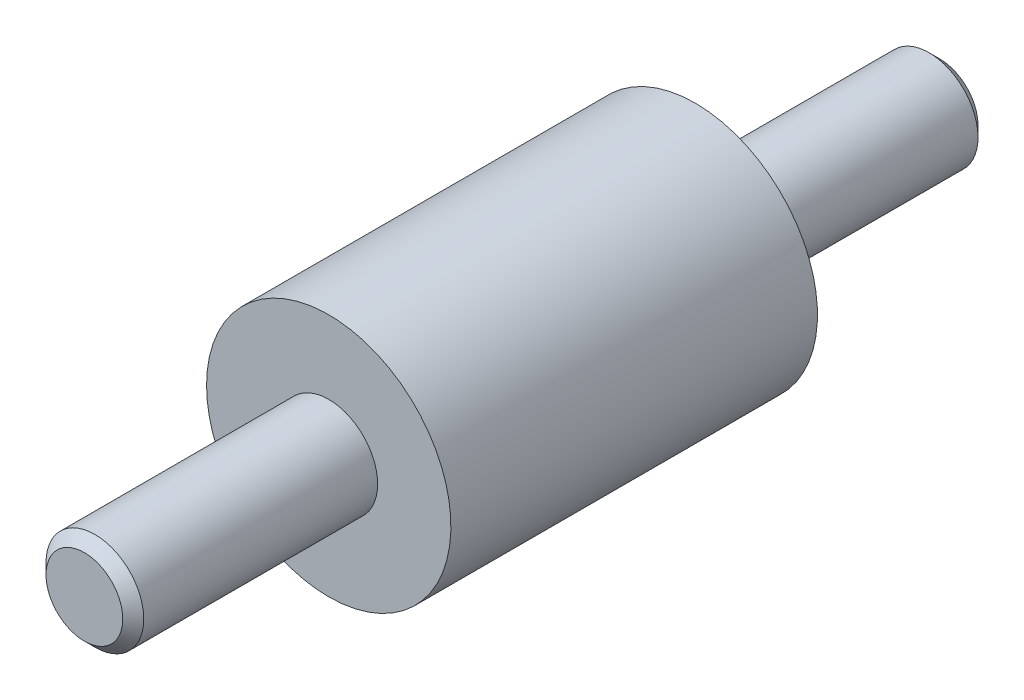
ISO-10303-21;
HEADER;
FILE_DESCRIPTION(('STEP AP214'),'2;1');
FILE_NAME('part.step','',(''),(''),'','','');
FILE_SCHEMA(('AUTOMOTIVE_DESIGN { 1 0 10303 214 1 1 1 1 }'));
ENDSEC;
DATA;
#1=APPLICATION_CONTEXT('core data for automotive mechanical design processes');
#2=APPLICATION_PROTOCOL_DEFINITION('international standard','automotive_design',2000,#1);
#3=PRODUCT_CONTEXT('',#1,'mechanical');
#4=PRODUCT('Part','Part','',(#3));
#5=PRODUCT_RELATED_PRODUCT_CATEGORY('part','',(#4));
#6=PRODUCT_DEFINITION_FORMATION('','',#4);
#7=PRODUCT_DEFINITION_CONTEXT('part definition',#1,'design');
#8=PRODUCT_DEFINITION('design','',#6,#7);
#9=PRODUCT_DEFINITION_SHAPE('','',#8);
#10=(LENGTH_UNIT() NAMED_UNIT(*) SI_UNIT(.MILLI.,.METRE.));
#11=(NAMED_UNIT(*) PLANE_ANGLE_UNIT() SI_UNIT($,.RADIAN.));
#12=(NAMED_UNIT(*) SI_UNIT($,.STERADIAN.) SOLID_ANGLE_UNIT());
#13=UNCERTAINTY_MEASURE_WITH_UNIT(LENGTH_MEASURE(1.E-05),#10,'distance_accuracy_value','');
#14=(GEOMETRIC_REPRESENTATION_CONTEXT(3) GLOBAL_UNCERTAINTY_ASSIGNED_CONTEXT((#13)) GLOBAL_UNIT_ASSIGNED_CONTEXT((#10,
#11,#12)) REPRESENTATION_CONTEXT('',''));
#15=CARTESIAN_POINT('',(0.,0.,0.));
#16=DIRECTION('',(0.,0.,1.));
#17=DIRECTION('',(1.,0.,0.));
#18=AXIS2_PLACEMENT_3D('',#15,#16,#17);
#19=CARTESIAN_POINT('',(0.,0.,0.33333333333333));
#20=DIRECTION('',(0.,0.,1.));
#21=DIRECTION('',(0.,-1.,0.));
#22=AXIS2_PLACEMENT_3D('',#19,#20,#21);
#23=CYLINDRICAL_SURFACE('',#22,5.);
#24=CARTESIAN_POINT('',(0.,0.,0.));
#25=DIRECTION('',(0.,0.,1.));
#26=DIRECTION('',(0.,-1.,0.));
#27=AXIS2_PLACEMENT_3D('',#24,#25,#26);
#28=CIRCLE('',#27,5.);
#29=CARTESIAN_POINT('',(0.,-5.,0.));
#30=VERTEX_POINT('',#29);
#31=EDGE_CURVE('E22',#30,#30,#28,.T.);
#32=ORIENTED_EDGE('',*,*,#31,.T.);
#33=EDGE_LOOP('',(#32));
#34=FACE_BOUND('',#33,.T.);
#35=CARTESIAN_POINT('',(0.,0.,15.));
#36=DIRECTION('',(0.,0.,-1.));
#37=DIRECTION('',(-1.,0.,0.));
#38=AXIS2_PLACEMENT_3D('',#35,#36,#37);
#39=CIRCLE('',#38,5.);
#40=CARTESIAN_POINT('',(-5.,0.,15.));
#41=VERTEX_POINT('',#40);
#42=EDGE_CURVE('E34',#41,#41,#39,.T.);
#43=ORIENTED_EDGE('',*,*,#42,.T.);
#44=EDGE_LOOP('',(#43));
#45=FACE_BOUND('',#44,.T.);
#46=ADVANCED_FACE('F12',(#34,#45),#23,.T.);
#47=CARTESIAN_POINT('',(5.,0.,0.));
#48=DIRECTION('',(0.,0.,-1.));
#49=DIRECTION('',(0.,1.,0.));
#50=AXIS2_PLACEMENT_3D('',#47,#48,#49);
#51=PLANE('',#50);
#52=CARTESIAN_POINT('',(0.,0.,0.));
#53=DIRECTION('',(0.,0.,-1.));
#54=DIRECTION('',(0.,1.,0.));
#55=AXIS2_PLACEMENT_3D('',#52,#53,#54);
#56=CIRCLE('',#55,2.);
#57=CARTESIAN_POINT('',(0.,2.,0.));
#58=VERTEX_POINT('',#57);
#59=EDGE_CURVE('E18',#58,#58,#56,.T.);
#60=ORIENTED_EDGE('',*,*,#59,.F.);
#61=EDGE_LOOP('',(#60));
#62=FACE_BOUND('',#61,.T.);
#63=ORIENTED_EDGE('',*,*,#31,.F.);
#64=EDGE_LOOP('',(#63));
#65=FACE_BOUND('',#64,.T.);
#66=ADVANCED_FACE('F57',(#62,#65),#51,.T.);
#67=CARTESIAN_POINT('',(0.,0.,-10.));
#68=DIRECTION('',(0.,0.,1.));
#69=DIRECTION('',(0.,-1.,0.));
#70=AXIS2_PLACEMENT_3D('',#67,#68,#69);
#71=CYLINDRICAL_SURFACE('',#70,2.);
#72=CARTESIAN_POINT('',(0.,0.,-9.5705));
#73=DIRECTION('',(0.,0.,1.));
#74=DIRECTION('',(0.,-1.,0.));
#75=AXIS2_PLACEMENT_3D('',#72,#73,#74);
#76=CIRCLE('',#75,2.);
#77=CARTESIAN_POINT('',(0.,-2.,-9.5705));
#78=VERTEX_POINT('',#77);
#79=EDGE_CURVE('E26',#78,#78,#76,.T.);
#80=ORIENTED_EDGE('',*,*,#79,.T.);
#81=EDGE_LOOP('',(#80));
#82=FACE_BOUND('',#81,.T.);
#83=ORIENTED_EDGE('',*,*,#59,.T.);
#84=EDGE_LOOP('',(#83));
#85=FACE_BOUND('',#84,.T.);
#86=ADVANCED_FACE('F62',(#82,#85),#71,.T.);
#87=CARTESIAN_POINT('',(0.,0.,-9.5705));
#88=DIRECTION('',(0.,0.,1.));
#89=DIRECTION('',(0.,-1.,0.));
#90=AXIS2_PLACEMENT_3D('',#87,#88,#89);
#91=CONICAL_SURFACE('',#90,2.,0.785398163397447);
#92=CARTESIAN_POINT('',(0.,0.,-10.));
#93=DIRECTION('',(0.,0.,1.));
#94=DIRECTION('',(0.,-1.,0.));
#95=AXIS2_PLACEMENT_3D('',#92,#93,#94);
#96=CIRCLE('',#95,1.5705);
#97=CARTESIAN_POINT('',(0.,-1.5705,-10.));
#98=VERTEX_POINT('',#97);
#99=EDGE_CURVE('E31',#98,#98,#96,.T.);
#100=ORIENTED_EDGE('',*,*,#99,.T.);
#101=EDGE_LOOP('',(#100));
#102=FACE_BOUND('',#101,.T.);
#103=ORIENTED_EDGE('',*,*,#79,.F.);
#104=EDGE_LOOP('',(#103));
#105=FACE_BOUND('',#104,.T.);
#106=ADVANCED_FACE('F78',(#102,#105),#91,.T.);
#107=CARTESIAN_POINT('',(1.5705,0.,-10.));
#108=DIRECTION('',(0.,0.,-1.));
#109=DIRECTION('',(0.,1.,0.));
#110=AXIS2_PLACEMENT_3D('',#107,#108,#109);
#111=PLANE('',#110);
#112=ORIENTED_EDGE('',*,*,#99,.F.);
#113=EDGE_LOOP('',(#112));
#114=FACE_BOUND('',#113,.T.);
#115=ADVANCED_FACE('F70',(#114),#111,.T.);
#116=CARTESIAN_POINT('',(0.,2.,15.));
#117=DIRECTION('',(0.,0.,1.));
#118=DIRECTION('',(1.,0.,0.));
#119=AXIS2_PLACEMENT_3D('',#116,#117,#118);
#120=PLANE('',#119);
#121=CARTESIAN_POINT('',(0.,0.,15.));
#122=DIRECTION('',(0.,0.,1.));
#123=DIRECTION('',(1.,0.,0.));
#124=AXIS2_PLACEMENT_3D('',#121,#122,#123);
#125=CIRCLE('',#124,2.);
#126=CARTESIAN_POINT('',(2.,0.,15.));
#127=VERTEX_POINT('',#126);
#128=EDGE_CURVE('E8',#127,#127,#125,.F.);
#129=ORIENTED_EDGE('',*,*,#128,.T.);
#130=EDGE_LOOP('',(#129));
#131=FACE_BOUND('',#130,.T.);
#132=ORIENTED_EDGE('',*,*,#42,.F.);
#133=EDGE_LOOP('',(#132));
#134=FACE_BOUND('',#133,.T.);
#135=ADVANCED_FACE('F68',(#131,#134),#120,.T.);
#136=CARTESIAN_POINT('',(0.,0.,10.));
#137=DIRECTION('',(0.,0.,1.));
#138=DIRECTION('',(0.,-1.,0.));
#139=AXIS2_PLACEMENT_3D('',#136,#137,#138);
#140=CYLINDRICAL_SURFACE('',#139,2.);
#141=ORIENTED_EDGE('',*,*,#128,.F.);
#142=EDGE_LOOP('',(#141));
#143=FACE_BOUND('',#142,.T.);
#144=CARTESIAN_POINT('',(0.,0.,24.5705));
#145=DIRECTION('',(0.,0.,-1.));
#146=DIRECTION('',(-1.,0.,0.));
#147=AXIS2_PLACEMENT_3D('',#144,#145,#146);
#148=CIRCLE('',#147,2.);
#149=CARTESIAN_POINT('',(-2.,0.,24.5705));
#150=VERTEX_POINT('',#149);
#151=EDGE_CURVE('E37',#150,#150,#148,.T.);
#152=ORIENTED_EDGE('',*,*,#151,.T.);
#153=EDGE_LOOP('',(#152));
#154=FACE_BOUND('',#153,.T.);
#155=ADVANCED_FACE('F54',(#143,#154),#140,.T.);
#156=CARTESIAN_POINT('',(0.,0.,24.5705));
#157=DIRECTION('',(0.,0.,-1.));
#158=DIRECTION('',(-1.,0.,0.));
#159=AXIS2_PLACEMENT_3D('',#156,#157,#158);
#160=CONICAL_SURFACE('',#159,2.,0.785398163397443);
#161=CARTESIAN_POINT('',(0.,0.,25.));
#162=DIRECTION('',(0.,0.,-1.));
#163=DIRECTION('',(-1.,0.,0.));
#164=AXIS2_PLACEMENT_3D('',#161,#162,#163);
#165=CIRCLE('',#164,1.5705);
#166=CARTESIAN_POINT('',(-1.5705,0.,25.));
#167=VERTEX_POINT('',#166);
#168=EDGE_CURVE('E40',#167,#167,#165,.T.);
#169=ORIENTED_EDGE('',*,*,#168,.T.);
#170=EDGE_LOOP('',(#169));
#171=FACE_BOUND('',#170,.T.);
#172=ORIENTED_EDGE('',*,*,#151,.F.);
#173=EDGE_LOOP('',(#172));
#174=FACE_BOUND('',#173,.T.);
#175=ADVANCED_FACE('F44',(#171,#174),#160,.T.);
#176=CARTESIAN_POINT('',(0.,0.,25.));
#177=DIRECTION('',(0.,0.,1.));
#178=DIRECTION('',(1.,0.,0.));
#179=AXIS2_PLACEMENT_3D('',#176,#177,#178);
#180=PLANE('',#179);
#181=ORIENTED_EDGE('',*,*,#168,.F.);
#182=EDGE_LOOP('',(#181));
#183=FACE_BOUND('',#182,.T.);
#184=ADVANCED_FACE('F47',(#183),#180,.T.);
#185=CLOSED_SHELL('',(#46,#66,#86,#106,#115,#135,#155,#175,#184));
#186=MANIFOLD_SOLID_BREP('B1',#185);
#187=ADVANCED_BREP_SHAPE_REPRESENTATION('',(#18,#186),#14);
#188=SHAPE_DEFINITION_REPRESENTATION(#9,#187);
ENDSEC;
END-ISO-10303-21;
